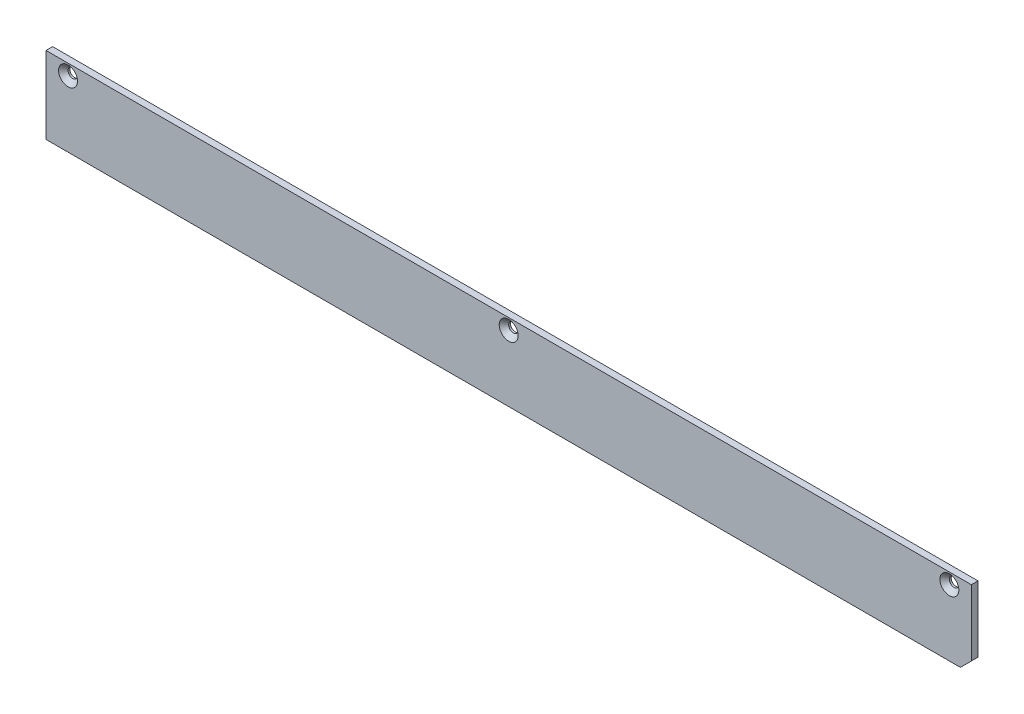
ISO-10303-21;
HEADER;
FILE_DESCRIPTION(('STEP AP214'),'2;1');
FILE_NAME('part.step','',(''),(''),'','','');
FILE_SCHEMA(('AUTOMOTIVE_DESIGN { 1 0 10303 214 1 1 1 1 }'));
ENDSEC;
DATA;
#1=APPLICATION_CONTEXT('core data for automotive mechanical design processes');
#2=APPLICATION_PROTOCOL_DEFINITION('international standard','automotive_design',2000,#1);
#3=PRODUCT_CONTEXT('',#1,'mechanical');
#4=PRODUCT('Part','Part','',(#3));
#5=PRODUCT_RELATED_PRODUCT_CATEGORY('part','',(#4));
#6=PRODUCT_DEFINITION_FORMATION('','',#4);
#7=PRODUCT_DEFINITION_CONTEXT('part definition',#1,'design');
#8=PRODUCT_DEFINITION('design','',#6,#7);
#9=PRODUCT_DEFINITION_SHAPE('','',#8);
#10=(LENGTH_UNIT() NAMED_UNIT(*) SI_UNIT(.MILLI.,.METRE.));
#11=(NAMED_UNIT(*) PLANE_ANGLE_UNIT() SI_UNIT($,.RADIAN.));
#12=(NAMED_UNIT(*) SI_UNIT($,.STERADIAN.) SOLID_ANGLE_UNIT());
#13=UNCERTAINTY_MEASURE_WITH_UNIT(LENGTH_MEASURE(1.E-05),#10,'distance_accuracy_value','');
#14=(GEOMETRIC_REPRESENTATION_CONTEXT(3) GLOBAL_UNCERTAINTY_ASSIGNED_CONTEXT((#13)) GLOBAL_UNIT_ASSIGNED_CONTEXT((#10,
#11,#12)) REPRESENTATION_CONTEXT('',''));
#15=CARTESIAN_POINT('',(0.,0.,0.));
#16=DIRECTION('',(0.,0.,1.));
#17=DIRECTION('',(1.,0.,0.));
#18=AXIS2_PLACEMENT_3D('',#15,#16,#17);
#19=CARTESIAN_POINT('',(0.,0.,2.99999999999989));
#20=DIRECTION('',(1.,0.,0.));
#21=DIRECTION('',(0.,0.,-0.999999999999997));
#22=AXIS2_PLACEMENT_3D('',#19,#20,#21);
#23=PLANE('',#22);
#24=DIRECTION('',(0.,-1.,0.));
#25=VECTOR('',#24,1.);
#26=CARTESIAN_POINT('',(0.,0.,0.));
#27=LINE('',#26,#25);
#28=CARTESIAN_POINT('',(4.9960036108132E-13,35.0000000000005,-4.44089209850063E-13));
#29=VERTEX_POINT('',#28);
#30=CARTESIAN_POINT('',(0.,0.,0.));
#31=VERTEX_POINT('',#30);
#32=EDGE_CURVE('E100',#29,#31,#27,.T.);
#33=ORIENTED_EDGE('',*,*,#32,.T.);
#34=DIRECTION('',(0.,0.,-0.999999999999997));
#35=VECTOR('',#34,1.);
#36=CARTESIAN_POINT('',(0.,0.,2.99999999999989));
#37=LINE('',#36,#35);
#38=CARTESIAN_POINT('',(0.,0.,2.99999999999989));
#39=VERTEX_POINT('',#38);
#40=EDGE_CURVE('E83',#39,#31,#37,.T.);
#41=ORIENTED_EDGE('',*,*,#40,.F.);
#42=DIRECTION('',(0.,-1.,0.));
#43=VECTOR('',#42,1.);
#44=CARTESIAN_POINT('',(0.,0.,2.99999999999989));
#45=LINE('',#44,#43);
#46=CARTESIAN_POINT('',(7.7715611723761E-13,35.0000000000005,2.99999999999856));
#47=VERTEX_POINT('',#46);
#48=EDGE_CURVE('E88',#47,#39,#45,.T.);
#49=ORIENTED_EDGE('',*,*,#48,.F.);
#50=DIRECTION('',(0.,0.,-0.999999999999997));
#51=VECTOR('',#50,1.);
#52=CARTESIAN_POINT('',(7.7715611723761E-13,35.0000000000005,2.99999999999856));
#53=LINE('',#52,#51);
#54=EDGE_CURVE('E107',#47,#29,#53,.T.);
#55=ORIENTED_EDGE('',*,*,#54,.T.);
#56=EDGE_LOOP('',(#33,#41,#49,#55));
#57=FACE_BOUND('',#56,.T.);
#58=ADVANCED_FACE('F36',(#57),#23,.F.);
#59=CARTESIAN_POINT('',(0.,0.,2.99999999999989));
#60=DIRECTION('',(0.,1.,0.));
#61=DIRECTION('',(0.,0.,0.999999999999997));
#62=AXIS2_PLACEMENT_3D('',#59,#60,#61);
#63=PLANE('',#62);
#64=DIRECTION('',(1.,0.,0.));
#65=VECTOR('',#64,1.);
#66=CARTESIAN_POINT('',(0.,0.,0.));
#67=LINE('',#66,#65);
#68=CARTESIAN_POINT('',(415.000000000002,0.,-6.66133814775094E-13));
#69=VERTEX_POINT('',#68);
#70=EDGE_CURVE('E115',#31,#69,#67,.T.);
#71=ORIENTED_EDGE('',*,*,#70,.T.);
#72=DIRECTION('',(0.,0.,0.999999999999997));
#73=VECTOR('',#72,1.);
#74=CARTESIAN_POINT('',(415.000000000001,2.4980018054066E-13,2.99999999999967));
#75=LINE('',#74,#73);
#76=CARTESIAN_POINT('',(415.000000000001,2.4980018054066E-13,2.99999999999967));
#77=VERTEX_POINT('',#76);
#78=EDGE_CURVE('E44',#69,#77,#75,.T.);
#79=ORIENTED_EDGE('',*,*,#78,.T.);
#80=DIRECTION('',(1.,0.,0.));
#81=VECTOR('',#80,1.);
#82=CARTESIAN_POINT('',(0.,0.,2.99999999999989));
#83=LINE('',#82,#81);
#84=EDGE_CURVE('E79',#39,#77,#83,.T.);
#85=ORIENTED_EDGE('',*,*,#84,.F.);
#86=ORIENTED_EDGE('',*,*,#40,.T.);
#87=EDGE_LOOP('',(#71,#79,#85,#86));
#88=FACE_BOUND('',#87,.T.);
#89=ADVANCED_FACE('F81',(#88),#63,.F.);
#90=CARTESIAN_POINT('',(420.000000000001,1.94289029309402E-13,2.99999999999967));
#91=DIRECTION('',(-1.,0.,0.));
#92=DIRECTION('',(0.,0.,0.999999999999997));
#93=AXIS2_PLACEMENT_3D('',#90,#91,#92);
#94=PLANE('',#93);
#95=DIRECTION('',(0.,1.,0.));
#96=VECTOR('',#95,1.);
#97=CARTESIAN_POINT('',(420.000000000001,1.94289029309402E-13,2.99999999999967));
#98=LINE('',#97,#96);
#99=CARTESIAN_POINT('',(420.000000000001,4.99999999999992,2.99999999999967));
#100=VERTEX_POINT('',#99);
#101=CARTESIAN_POINT('',(420.000000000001,35.0000000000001,2.99999999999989));
#102=VERTEX_POINT('',#101);
#103=EDGE_CURVE('E87',#100,#102,#98,.T.);
#104=ORIENTED_EDGE('',*,*,#103,.F.);
#105=DIRECTION('',(0.,0.,-0.999999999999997));
#106=VECTOR('',#105,1.);
#107=CARTESIAN_POINT('',(420.000000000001,4.99999999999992,2.99999999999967));
#108=LINE('',#107,#106);
#109=CARTESIAN_POINT('',(420.000000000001,5.00000000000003,-7.7715611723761E-13));
#110=VERTEX_POINT('',#109);
#111=EDGE_CURVE('E101',#100,#110,#108,.T.);
#112=ORIENTED_EDGE('',*,*,#111,.T.);
#113=DIRECTION('',(0.,1.,0.));
#114=VECTOR('',#113,1.);
#115=CARTESIAN_POINT('',(420.000000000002,4.44089209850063E-13,-6.66133814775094E-13));
#116=LINE('',#115,#114);
#117=CARTESIAN_POINT('',(420.000000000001,35.,-4.44089209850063E-13));
#118=VERTEX_POINT('',#117);
#119=EDGE_CURVE('E113',#110,#118,#116,.T.);
#120=ORIENTED_EDGE('',*,*,#119,.T.);
#121=DIRECTION('',(0.,0.,-0.999999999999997));
#122=VECTOR('',#121,1.);
#123=CARTESIAN_POINT('',(420.000000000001,35.0000000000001,2.99999999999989));
#124=LINE('',#123,#122);
#125=EDGE_CURVE('E102',#102,#118,#124,.T.);
#126=ORIENTED_EDGE('',*,*,#125,.F.);
#127=EDGE_LOOP('',(#104,#112,#120,#126));
#128=FACE_BOUND('',#127,.T.);
#129=ADVANCED_FACE('F173',(#128),#94,.F.);
#130=CARTESIAN_POINT('',(7.7715611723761E-13,35.0000000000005,2.99999999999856));
#131=DIRECTION('',(0.,-1.,0.));
#132=DIRECTION('',(0.,0.,-0.999999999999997));
#133=AXIS2_PLACEMENT_3D('',#130,#131,#132);
#134=PLANE('',#133);
#135=DIRECTION('',(-1.,0.,0.));
#136=VECTOR('',#135,1.);
#137=CARTESIAN_POINT('',(4.9960036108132E-13,35.0000000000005,-4.44089209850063E-13));
#138=LINE('',#137,#136);
#139=EDGE_CURVE('E97',#118,#29,#138,.T.);
#140=ORIENTED_EDGE('',*,*,#139,.T.);
#141=ORIENTED_EDGE('',*,*,#54,.F.);
#142=DIRECTION('',(-1.,0.,0.));
#143=VECTOR('',#142,1.);
#144=CARTESIAN_POINT('',(7.7715611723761E-13,35.0000000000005,2.99999999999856));
#145=LINE('',#144,#143);
#146=EDGE_CURVE('E93',#102,#47,#145,.T.);
#147=ORIENTED_EDGE('',*,*,#146,.F.);
#148=ORIENTED_EDGE('',*,*,#125,.T.);
#149=EDGE_LOOP('',(#140,#141,#147,#148));
#150=FACE_BOUND('',#149,.T.);
#151=ADVANCED_FACE('F165',(#150),#134,.F.);
#152=CARTESIAN_POINT('',(0.,0.,2.99999999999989));
#153=DIRECTION('',(0.,0.,-0.999999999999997));
#154=DIRECTION('',(-1.,0.,0.));
#155=AXIS2_PLACEMENT_3D('',#152,#153,#154);
#156=PLANE('',#155);
#157=CARTESIAN_POINT('',(10.0000000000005,30.0000000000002,2.99999999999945));
#158=DIRECTION('',(0.,0.,0.999999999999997));
#159=DIRECTION('',(1.,0.,0.));
#160=AXIS2_PLACEMENT_3D('',#157,#158,#159);
#161=CIRCLE('',#160,4.3);
#162=CARTESIAN_POINT('',(14.3000000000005,30.0000000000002,2.99999999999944));
#163=VERTEX_POINT('',#162);
#164=EDGE_CURVE('E118',#163,#163,#161,.T.);
#165=ORIENTED_EDGE('',*,*,#164,.F.);
#166=EDGE_LOOP('',(#165));
#167=FACE_BOUND('',#166,.T.);
#168=CARTESIAN_POINT('',(210.000000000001,30.0000000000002,2.99999999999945));
#169=DIRECTION('',(0.,0.,0.999999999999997));
#170=DIRECTION('',(1.,0.,0.));
#171=AXIS2_PLACEMENT_3D('',#168,#169,#170);
#172=CIRCLE('',#171,4.3);
#173=CARTESIAN_POINT('',(214.300000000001,30.0000000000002,2.99999999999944));
#174=VERTEX_POINT('',#173);
#175=EDGE_CURVE('E124',#174,#174,#172,.T.);
#176=ORIENTED_EDGE('',*,*,#175,.F.);
#177=EDGE_LOOP('',(#176));
#178=FACE_BOUND('',#177,.T.);
#179=CARTESIAN_POINT('',(410.000000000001,30.0000000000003,2.99999999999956));
#180=DIRECTION('',(0.,0.,0.999999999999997));
#181=DIRECTION('',(1.,0.,0.));
#182=AXIS2_PLACEMENT_3D('',#179,#180,#181);
#183=CIRCLE('',#182,4.30000000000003);
#184=CARTESIAN_POINT('',(414.300000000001,30.0000000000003,2.99999999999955));
#185=VERTEX_POINT('',#184);
#186=EDGE_CURVE('E121',#185,#185,#183,.T.);
#187=ORIENTED_EDGE('',*,*,#186,.F.);
#188=EDGE_LOOP('',(#187));
#189=FACE_BOUND('',#188,.T.);
#190=ORIENTED_EDGE('',*,*,#84,.T.);
#191=DIRECTION('',(-0.707106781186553,-0.707106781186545,0.));
#192=VECTOR('',#191,1.);
#193=CARTESIAN_POINT('',(420.000000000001,4.99999999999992,2.99999999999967));
#194=LINE('',#193,#192);
#195=EDGE_CURVE('E11',#77,#100,#194,.F.);
#196=ORIENTED_EDGE('',*,*,#195,.T.);
#197=ORIENTED_EDGE('',*,*,#103,.T.);
#198=ORIENTED_EDGE('',*,*,#146,.T.);
#199=ORIENTED_EDGE('',*,*,#48,.T.);
#200=EDGE_LOOP('',(#190,#196,#197,#198,#199));
#201=FACE_BOUND('',#200,.T.);
#202=ADVANCED_FACE('F91',(#167,#178,#189,#201),#156,.F.);
#203=CARTESIAN_POINT('',(0.,0.,0.));
#204=DIRECTION('',(0.,0.,-0.999999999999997));
#205=DIRECTION('',(-1.,0.,0.));
#206=AXIS2_PLACEMENT_3D('',#203,#204,#205);
#207=PLANE('',#206);
#208=CARTESIAN_POINT('',(410.000000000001,30.,-2.22044604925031E-13));
#209=DIRECTION('',(0.,0.,0.999999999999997));
#210=DIRECTION('',(1.,0.,0.));
#211=AXIS2_PLACEMENT_3D('',#208,#209,#210);
#212=CIRCLE('',#211,2.15000000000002);
#213=CARTESIAN_POINT('',(412.150000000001,30.,-2.24849305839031E-13));
#214=VERTEX_POINT('',#213);
#215=EDGE_CURVE('E139',#214,#214,#212,.T.);
#216=ORIENTED_EDGE('',*,*,#215,.T.);
#217=EDGE_LOOP('',(#216));
#218=FACE_BOUND('',#217,.T.);
#219=CARTESIAN_POINT('',(210.000000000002,30.0000000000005,-6.66133814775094E-13));
#220=DIRECTION('',(0.,0.,0.999999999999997));
#221=DIRECTION('',(1.,0.,0.));
#222=AXIS2_PLACEMENT_3D('',#219,#220,#221);
#223=CIRCLE('',#222,2.15000000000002);
#224=CARTESIAN_POINT('',(212.150000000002,30.0000000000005,-6.68938515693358E-13));
#225=VERTEX_POINT('',#224);
#226=EDGE_CURVE('E133',#225,#225,#223,.T.);
#227=ORIENTED_EDGE('',*,*,#226,.T.);
#228=EDGE_LOOP('',(#227));
#229=FACE_BOUND('',#228,.T.);
#230=CARTESIAN_POINT('',(10.0000000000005,30.0000000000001,-2.22044604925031E-13));
#231=DIRECTION('',(0.,0.,0.999999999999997));
#232=DIRECTION('',(1.,0.,0.));
#233=AXIS2_PLACEMENT_3D('',#230,#231,#232);
#234=CIRCLE('',#233,2.14999999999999);
#235=CARTESIAN_POINT('',(12.1500000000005,30.0000000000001,-2.24849305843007E-13));
#236=VERTEX_POINT('',#235);
#237=EDGE_CURVE('E125',#236,#236,#234,.T.);
#238=ORIENTED_EDGE('',*,*,#237,.T.);
#239=EDGE_LOOP('',(#238));
#240=FACE_BOUND('',#239,.T.);
#241=ORIENTED_EDGE('',*,*,#119,.F.);
#242=DIRECTION('',(0.707106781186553,0.707106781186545,0.));
#243=VECTOR('',#242,1.);
#244=CARTESIAN_POINT('',(207.499999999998,-207.5,-2.22044604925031E-13));
#245=LINE('',#244,#243);
#246=EDGE_CURVE('E58',#110,#69,#245,.F.);
#247=ORIENTED_EDGE('',*,*,#246,.T.);
#248=ORIENTED_EDGE('',*,*,#70,.F.);
#249=ORIENTED_EDGE('',*,*,#32,.F.);
#250=ORIENTED_EDGE('',*,*,#139,.F.);
#251=EDGE_LOOP('',(#241,#247,#248,#249,#250));
#252=FACE_BOUND('',#251,.T.);
#253=ADVANCED_FACE('F148',(#218,#229,#240,#252),#207,.T.);
#254=CARTESIAN_POINT('',(410.000000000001,30.0000000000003,2.99999999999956));
#255=DIRECTION('',(0.,0.,0.999999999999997));
#256=DIRECTION('',(1.,0.,0.));
#257=AXIS2_PLACEMENT_3D('',#254,#255,#256);
#258=CONICAL_SURFACE('',#257,4.30000000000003,0.78539816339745);
#259=CARTESIAN_POINT('',(410.,30.,0.849999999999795));
#260=DIRECTION('',(0.,0.,0.999999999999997));
#261=DIRECTION('',(1.,0.,0.));
#262=AXIS2_PLACEMENT_3D('',#259,#260,#261);
#263=CIRCLE('',#262,2.15000000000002);
#264=CARTESIAN_POINT('',(412.150000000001,30.0000000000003,0.849999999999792));
#265=VERTEX_POINT('',#264);
#266=EDGE_CURVE('E142',#265,#265,#263,.T.);
#267=CARTESIAN_POINT('',(412.150000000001,30.0000000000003,0.849999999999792));
#268=CARTESIAN_POINT('',(412.172395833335,30.0000000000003,0.87239583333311));
#269=CARTESIAN_POINT('',(412.194791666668,30.0000000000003,0.894791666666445));
#270=CARTESIAN_POINT('',(412.239583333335,30.0000000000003,0.939583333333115));
#271=CARTESIAN_POINT('',(412.261979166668,30.0000000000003,0.96197916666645));
#272=CARTESIAN_POINT('',(412.306770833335,30.0000000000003,1.00677083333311));
#273=CARTESIAN_POINT('',(412.329166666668,30.0000000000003,1.02916666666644));
#274=CARTESIAN_POINT('',(412.373958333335,30.0000000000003,1.0739583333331));
#275=CARTESIAN_POINT('',(412.396354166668,30.0000000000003,1.09635416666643));
#276=CARTESIAN_POINT('',(412.441145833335,30.0000000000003,1.14114583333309));
#277=CARTESIAN_POINT('',(412.463541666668,30.0000000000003,1.16354166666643));
#278=CARTESIAN_POINT('',(412.508333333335,30.0000000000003,1.20833333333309));
#279=CARTESIAN_POINT('',(412.530729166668,30.0000000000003,1.23072916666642));
#280=CARTESIAN_POINT('',(412.575520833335,30.0000000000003,1.27552083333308));
#281=CARTESIAN_POINT('',(412.597916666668,30.0000000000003,1.2979166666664));
#282=CARTESIAN_POINT('',(412.642708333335,30.0000000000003,1.34270833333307));
#283=CARTESIAN_POINT('',(412.665104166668,30.0000000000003,1.36510416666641));
#284=CARTESIAN_POINT('',(412.709895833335,30.0000000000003,1.40989583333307));
#285=CARTESIAN_POINT('',(412.732291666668,30.0000000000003,1.4322916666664));
#286=CARTESIAN_POINT('',(412.777083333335,30.0000000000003,1.47708333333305));
#287=CARTESIAN_POINT('',(412.799479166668,30.0000000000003,1.49947916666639));
#288=CARTESIAN_POINT('',(412.844270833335,30.0000000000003,1.54427083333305));
#289=CARTESIAN_POINT('',(412.866666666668,30.0000000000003,1.56666666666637));
#290=CARTESIAN_POINT('',(412.911458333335,30.0000000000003,1.61145833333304));
#291=CARTESIAN_POINT('',(412.933854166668,30.0000000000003,1.63385416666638));
#292=CARTESIAN_POINT('',(412.978645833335,30.0000000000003,1.67864583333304));
#293=CARTESIAN_POINT('',(413.001041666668,30.0000000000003,1.70104166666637));
#294=CARTESIAN_POINT('',(413.045833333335,30.0000000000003,1.74583333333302));
#295=CARTESIAN_POINT('',(413.068229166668,30.0000000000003,1.76822916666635));
#296=CARTESIAN_POINT('',(413.113020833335,30.0000000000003,1.81302083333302));
#297=CARTESIAN_POINT('',(413.135416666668,30.0000000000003,1.83541666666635));
#298=CARTESIAN_POINT('',(413.180208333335,30.0000000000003,1.88020833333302));
#299=CARTESIAN_POINT('',(413.202604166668,30.0000000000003,1.90260416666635));
#300=CARTESIAN_POINT('',(413.247395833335,30.0000000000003,1.947395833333));
#301=CARTESIAN_POINT('',(413.269791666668,30.0000000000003,1.96979166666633));
#302=CARTESIAN_POINT('',(413.314583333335,30.0000000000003,2.01458333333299));
#303=CARTESIAN_POINT('',(413.336979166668,30.0000000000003,2.03697916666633));
#304=CARTESIAN_POINT('',(413.381770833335,30.0000000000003,2.08177083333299));
#305=CARTESIAN_POINT('',(413.404166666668,30.0000000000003,2.10416666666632));
#306=CARTESIAN_POINT('',(413.448958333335,30.0000000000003,2.14895833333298));
#307=CARTESIAN_POINT('',(413.471354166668,30.0000000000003,2.17135416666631));
#308=CARTESIAN_POINT('',(413.516145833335,30.0000000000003,2.21614583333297));
#309=CARTESIAN_POINT('',(413.538541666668,30.0000000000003,2.2385416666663));
#310=CARTESIAN_POINT('',(413.583333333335,30.0000000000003,2.28333333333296));
#311=CARTESIAN_POINT('',(413.605729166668,30.0000000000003,2.3057291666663));
#312=CARTESIAN_POINT('',(413.650520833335,30.0000000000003,2.35052083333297));
#313=CARTESIAN_POINT('',(413.672916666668,30.0000000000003,2.37291666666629));
#314=CARTESIAN_POINT('',(413.717708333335,30.0000000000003,2.41770833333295));
#315=CARTESIAN_POINT('',(413.740104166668,30.0000000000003,2.44010416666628));
#316=CARTESIAN_POINT('',(413.784895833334,30.0000000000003,2.48489583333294));
#317=CARTESIAN_POINT('',(413.807291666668,30.0000000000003,2.50729166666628));
#318=CARTESIAN_POINT('',(413.852083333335,30.0000000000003,2.55208333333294));
#319=CARTESIAN_POINT('',(413.874479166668,30.0000000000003,2.57447916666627));
#320=CARTESIAN_POINT('',(413.919270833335,30.0000000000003,2.61927083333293));
#321=CARTESIAN_POINT('',(413.941666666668,30.0000000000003,2.64166666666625));
#322=CARTESIAN_POINT('',(413.986458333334,30.0000000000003,2.68645833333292));
#323=CARTESIAN_POINT('',(414.008854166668,30.0000000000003,2.70885416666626));
#324=CARTESIAN_POINT('',(414.053645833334,30.0000000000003,2.75364583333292));
#325=CARTESIAN_POINT('',(414.076041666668,30.0000000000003,2.77604166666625));
#326=CARTESIAN_POINT('',(414.120833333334,30.0000000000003,2.8208333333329));
#327=CARTESIAN_POINT('',(414.143229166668,30.0000000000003,2.84322916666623));
#328=CARTESIAN_POINT('',(414.188020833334,30.0000000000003,2.8880208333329));
#329=CARTESIAN_POINT('',(414.210416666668,30.0000000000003,2.91041666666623));
#330=CARTESIAN_POINT('',(414.255208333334,30.0000000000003,2.9552083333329));
#331=CARTESIAN_POINT('',(414.277604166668,30.0000000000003,2.97760416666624));
#332=CARTESIAN_POINT('',(414.300000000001,30.0000000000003,2.99999999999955));
#333=B_SPLINE_CURVE_WITH_KNOTS('',3,(#267,#268,#269,#270,#271,#272,#273,#274,#275,#276,#277,
#278,#279,#280,#281,#282,#283,#284,#285,#286,#287,#288,#289,#290,#291,#292,#293,#294,#295,#296,
#297,#298,#299,#300,#301,#302,#303,#304,#305,#306,#307,#308,#309,#310,#311,#312,#313,#314,#315,
#316,#317,#318,#319,#320,#321,#322,#323,#324,#325,#326,#327,#328,#329,#330,#331,#332),
.UNSPECIFIED.,.F.,.F.,(4,2,2,2,2,2,2,2,2,2,2,2,2,2,2,2,2,2,2,2,2,2,2,2,2,2,2,2,2,2,2,2,4),(0.,
0.0950174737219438,0.190034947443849,0.285052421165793,0.380069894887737,0.475087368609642,
0.570104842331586,0.66512231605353,0.760139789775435,0.855157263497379,0.950174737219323,
1.04519221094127,1.14020968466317,1.23522715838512,1.33024463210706,1.42526210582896,
1.52027957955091,1.61529705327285,1.71031452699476,1.8053320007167,1.90034947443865,
1.99536694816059,2.0903844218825,2.18540189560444,2.28041936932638,2.37543684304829,
2.47045431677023,2.56547179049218,2.66048926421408,2.75550673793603,2.85052421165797,
2.94554168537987,3.04055915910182),.UNSPECIFIED.);
#334=EDGE_CURVE('BSEAM158',#265,#185,#333,.T.);
#335=ORIENTED_EDGE('',*,*,#266,.F.);
#336=ORIENTED_EDGE('',*,*,#186,.T.);
#337=ORIENTED_EDGE('',*,*,#334,.T.);
#338=ORIENTED_EDGE('',*,*,#334,.F.);
#339=EDGE_LOOP('',(#335,#337,#336,#338));
#340=FACE_BOUND('',#339,.T.);
#341=ADVANCED_FACE('F158',(#340),#258,.F.);
#342=CARTESIAN_POINT('',(210.000000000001,30.0000000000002,2.99999999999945));
#343=DIRECTION('',(0.,0.,0.999999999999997));
#344=DIRECTION('',(1.,0.,0.));
#345=AXIS2_PLACEMENT_3D('',#342,#343,#344);
#346=CONICAL_SURFACE('',#345,4.3,0.78539816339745);
#347=CARTESIAN_POINT('',(210.000000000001,30.0000000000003,0.850000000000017));
#348=DIRECTION('',(0.,0.,0.999999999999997));
#349=DIRECTION('',(1.,0.,0.));
#350=AXIS2_PLACEMENT_3D('',#347,#348,#349);
#351=CIRCLE('',#350,2.15000000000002);
#352=CARTESIAN_POINT('',(212.150000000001,30.0000000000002,0.850000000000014));
#353=VERTEX_POINT('',#352);
#354=EDGE_CURVE('E136',#353,#353,#351,.T.);
#355=CARTESIAN_POINT('',(212.150000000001,30.0000000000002,0.850000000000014));
#356=CARTESIAN_POINT('',(212.172395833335,30.0000000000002,0.872395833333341));
#357=CARTESIAN_POINT('',(212.194791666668,30.0000000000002,0.894791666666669));
#358=CARTESIAN_POINT('',(212.239583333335,30.0000000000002,0.939583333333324));
#359=CARTESIAN_POINT('',(212.261979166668,30.0000000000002,0.961979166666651));
#360=CARTESIAN_POINT('',(212.306770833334,30.0000000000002,1.00677083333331));
#361=CARTESIAN_POINT('',(212.329166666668,30.0000000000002,1.02916666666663));
#362=CARTESIAN_POINT('',(212.373958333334,30.0000000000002,1.07395833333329));
#363=CARTESIAN_POINT('',(212.396354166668,30.0000000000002,1.09635416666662));
#364=CARTESIAN_POINT('',(212.441145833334,30.0000000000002,1.14114583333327));
#365=CARTESIAN_POINT('',(212.463541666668,30.0000000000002,1.1635416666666));
#366=CARTESIAN_POINT('',(212.508333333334,30.0000000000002,1.20833333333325));
#367=CARTESIAN_POINT('',(212.530729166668,30.0000000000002,1.23072916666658));
#368=CARTESIAN_POINT('',(212.575520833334,30.0000000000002,1.27552083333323));
#369=CARTESIAN_POINT('',(212.597916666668,30.0000000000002,1.29791666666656));
#370=CARTESIAN_POINT('',(212.642708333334,30.0000000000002,1.34270833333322));
#371=CARTESIAN_POINT('',(212.665104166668,30.0000000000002,1.36510416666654));
#372=CARTESIAN_POINT('',(212.709895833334,30.0000000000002,1.4098958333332));
#373=CARTESIAN_POINT('',(212.732291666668,30.0000000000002,1.43229166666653));
#374=CARTESIAN_POINT('',(212.777083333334,30.0000000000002,1.47708333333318));
#375=CARTESIAN_POINT('',(212.799479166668,30.0000000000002,1.49947916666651));
#376=CARTESIAN_POINT('',(212.844270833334,30.0000000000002,1.54427083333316));
#377=CARTESIAN_POINT('',(212.866666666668,30.0000000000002,1.56666666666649));
#378=CARTESIAN_POINT('',(212.911458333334,30.0000000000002,1.61145833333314));
#379=CARTESIAN_POINT('',(212.933854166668,30.0000000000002,1.63385416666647));
#380=CARTESIAN_POINT('',(212.978645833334,30.0000000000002,1.67864583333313));
#381=CARTESIAN_POINT('',(213.001041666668,30.0000000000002,1.70104166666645));
#382=CARTESIAN_POINT('',(213.045833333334,30.0000000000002,1.74583333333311));
#383=CARTESIAN_POINT('',(213.068229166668,30.0000000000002,1.76822916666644));
#384=CARTESIAN_POINT('',(213.113020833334,30.0000000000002,1.81302083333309));
#385=CARTESIAN_POINT('',(213.135416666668,30.0000000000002,1.83541666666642));
#386=CARTESIAN_POINT('',(213.180208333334,30.0000000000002,1.88020833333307));
#387=CARTESIAN_POINT('',(213.202604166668,30.0000000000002,1.9026041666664));
#388=CARTESIAN_POINT('',(213.247395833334,30.0000000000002,1.94739583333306));
#389=CARTESIAN_POINT('',(213.269791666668,30.0000000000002,1.96979166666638));
#390=CARTESIAN_POINT('',(213.314583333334,30.0000000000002,2.01458333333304));
#391=CARTESIAN_POINT('',(213.336979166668,30.0000000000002,2.03697916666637));
#392=CARTESIAN_POINT('',(213.381770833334,30.0000000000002,2.08177083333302));
#393=CARTESIAN_POINT('',(213.404166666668,30.0000000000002,2.10416666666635));
#394=CARTESIAN_POINT('',(213.448958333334,30.0000000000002,2.148958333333));
#395=CARTESIAN_POINT('',(213.471354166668,30.0000000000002,2.17135416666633));
#396=CARTESIAN_POINT('',(213.516145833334,30.0000000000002,2.21614583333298));
#397=CARTESIAN_POINT('',(213.538541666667,30.0000000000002,2.23854166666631));
#398=CARTESIAN_POINT('',(213.583333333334,30.0000000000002,2.28333333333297));
#399=CARTESIAN_POINT('',(213.605729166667,30.0000000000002,2.30572916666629));
#400=CARTESIAN_POINT('',(213.650520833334,30.0000000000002,2.35052083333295));
#401=CARTESIAN_POINT('',(213.672916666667,30.0000000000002,2.37291666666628));
#402=CARTESIAN_POINT('',(213.717708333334,30.0000000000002,2.41770833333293));
#403=CARTESIAN_POINT('',(213.740104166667,30.0000000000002,2.44010416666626));
#404=CARTESIAN_POINT('',(213.784895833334,30.0000000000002,2.48489583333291));
#405=CARTESIAN_POINT('',(213.807291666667,30.0000000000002,2.50729166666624));
#406=CARTESIAN_POINT('',(213.852083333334,30.0000000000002,2.55208333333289));
#407=CARTESIAN_POINT('',(213.874479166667,30.0000000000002,2.57447916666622));
#408=CARTESIAN_POINT('',(213.919270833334,30.0000000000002,2.61927083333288));
#409=CARTESIAN_POINT('',(213.941666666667,30.0000000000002,2.6416666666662));
#410=CARTESIAN_POINT('',(213.986458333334,30.0000000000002,2.68645833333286));
#411=CARTESIAN_POINT('',(214.008854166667,30.0000000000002,2.70885416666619));
#412=CARTESIAN_POINT('',(214.053645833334,30.0000000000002,2.75364583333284));
#413=CARTESIAN_POINT('',(214.076041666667,30.0000000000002,2.77604166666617));
#414=CARTESIAN_POINT('',(214.120833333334,30.0000000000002,2.82083333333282));
#415=CARTESIAN_POINT('',(214.143229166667,30.0000000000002,2.84322916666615));
#416=CARTESIAN_POINT('',(214.188020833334,30.0000000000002,2.88802083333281));
#417=CARTESIAN_POINT('',(214.210416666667,30.0000000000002,2.91041666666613));
#418=CARTESIAN_POINT('',(214.255208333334,30.0000000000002,2.95520833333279));
#419=CARTESIAN_POINT('',(214.277604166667,30.0000000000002,2.97760416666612));
#420=CARTESIAN_POINT('',(214.300000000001,30.0000000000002,2.99999999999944));
#421=B_SPLINE_CURVE_WITH_KNOTS('',3,(#355,#356,#357,#358,#359,#360,#361,#362,#363,#364,#365,
#366,#367,#368,#369,#370,#371,#372,#373,#374,#375,#376,#377,#378,#379,#380,#381,#382,#383,#384,
#385,#386,#387,#388,#389,#390,#391,#392,#393,#394,#395,#396,#397,#398,#399,#400,#401,#402,#403,
#404,#405,#406,#407,#408,#409,#410,#411,#412,#413,#414,#415,#416,#417,#418,#419,#420),
.UNSPECIFIED.,.F.,.F.,(4,2,2,2,2,2,2,2,2,2,2,2,2,2,2,2,2,2,2,2,2,2,2,2,2,2,2,2,2,2,2,2,4),(0.,
0.0950174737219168,0.190034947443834,0.285052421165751,0.380069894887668,0.475087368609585,
0.570104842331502,0.66512231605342,0.760139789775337,0.855157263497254,0.950174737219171,
1.04519221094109,1.14020968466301,1.23522715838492,1.33024463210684,1.42526210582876,
1.52027957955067,1.61529705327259,1.71031452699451,1.80533200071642,1.90034947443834,
1.99536694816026,2.09038442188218,2.18540189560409,2.28041936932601,2.37543684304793,
2.47045431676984,2.56547179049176,2.66048926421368,2.75550673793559,2.85052421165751,
2.94554168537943,3.04055915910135),.UNSPECIFIED.);
#422=EDGE_CURVE('BSEAM161',#353,#174,#421,.T.);
#423=ORIENTED_EDGE('',*,*,#354,.F.);
#424=ORIENTED_EDGE('',*,*,#175,.T.);
#425=ORIENTED_EDGE('',*,*,#422,.T.);
#426=ORIENTED_EDGE('',*,*,#422,.F.);
#427=EDGE_LOOP('',(#423,#425,#424,#426));
#428=FACE_BOUND('',#427,.T.);
#429=ADVANCED_FACE('F161',(#428),#346,.F.);
#430=CARTESIAN_POINT('',(10.0000000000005,30.0000000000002,2.99999999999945));
#431=DIRECTION('',(0.,0.,0.999999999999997));
#432=DIRECTION('',(1.,0.,0.));
#433=AXIS2_PLACEMENT_3D('',#430,#431,#432);
#434=CONICAL_SURFACE('',#433,4.3,0.78539816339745);
#435=CARTESIAN_POINT('',(10.0000000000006,30.0000000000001,0.849999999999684));
#436=DIRECTION('',(0.,0.,0.999999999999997));
#437=DIRECTION('',(1.,0.,0.));
#438=AXIS2_PLACEMENT_3D('',#435,#436,#437);
#439=CIRCLE('',#438,2.14999999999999);
#440=CARTESIAN_POINT('',(12.1500000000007,30.0000000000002,0.849999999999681));
#441=VERTEX_POINT('',#440);
#442=EDGE_CURVE('E130',#441,#441,#439,.T.);
#443=CARTESIAN_POINT('',(12.1500000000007,30.0000000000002,0.849999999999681));
#444=CARTESIAN_POINT('',(12.172395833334,30.0000000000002,0.872395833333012));
#445=CARTESIAN_POINT('',(12.1947916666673,30.0000000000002,0.894791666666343));
#446=CARTESIAN_POINT('',(12.239583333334,30.0000000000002,0.939583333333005));
#447=CARTESIAN_POINT('',(12.2619791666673,30.0000000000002,0.961979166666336));
#448=CARTESIAN_POINT('',(12.306770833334,30.0000000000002,1.006770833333));
#449=CARTESIAN_POINT('',(12.3291666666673,30.0000000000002,1.02916666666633));
#450=CARTESIAN_POINT('',(12.373958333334,30.0000000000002,1.07395833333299));
#451=CARTESIAN_POINT('',(12.3963541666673,30.0000000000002,1.09635416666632));
#452=CARTESIAN_POINT('',(12.441145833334,30.0000000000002,1.14114583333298));
#453=CARTESIAN_POINT('',(12.4635416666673,30.0000000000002,1.16354166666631));
#454=CARTESIAN_POINT('',(12.508333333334,30.0000000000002,1.20833333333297));
#455=CARTESIAN_POINT('',(12.5307291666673,30.0000000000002,1.23072916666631));
#456=CARTESIAN_POINT('',(12.575520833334,30.0000000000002,1.27552083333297));
#457=CARTESIAN_POINT('',(12.5979166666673,30.0000000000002,1.2979166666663));
#458=CARTESIAN_POINT('',(12.642708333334,30.0000000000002,1.34270833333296));
#459=CARTESIAN_POINT('',(12.6651041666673,30.0000000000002,1.36510416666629));
#460=CARTESIAN_POINT('',(12.7098958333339,30.0000000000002,1.40989583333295));
#461=CARTESIAN_POINT('',(12.7322916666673,30.0000000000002,1.43229166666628));
#462=CARTESIAN_POINT('',(12.7770833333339,30.0000000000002,1.47708333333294));
#463=CARTESIAN_POINT('',(12.7994791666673,30.0000000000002,1.49947916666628));
#464=CARTESIAN_POINT('',(12.8442708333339,30.0000000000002,1.54427083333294));
#465=CARTESIAN_POINT('',(12.8666666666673,30.0000000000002,1.56666666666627));
#466=CARTESIAN_POINT('',(12.9114583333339,30.0000000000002,1.61145833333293));
#467=CARTESIAN_POINT('',(12.9338541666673,30.0000000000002,1.63385416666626));
#468=CARTESIAN_POINT('',(12.9786458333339,30.0000000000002,1.67864583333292));
#469=CARTESIAN_POINT('',(13.0010416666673,30.0000000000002,1.70104166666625));
#470=CARTESIAN_POINT('',(13.0458333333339,30.0000000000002,1.74583333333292));
#471=CARTESIAN_POINT('',(13.0682291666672,30.0000000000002,1.76822916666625));
#472=CARTESIAN_POINT('',(13.1130208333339,30.0000000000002,1.81302083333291));
#473=CARTESIAN_POINT('',(13.1354166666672,30.0000000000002,1.83541666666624));
#474=CARTESIAN_POINT('',(13.1802083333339,30.0000000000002,1.8802083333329));
#475=CARTESIAN_POINT('',(13.2026041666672,30.0000000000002,1.90260416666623));
#476=CARTESIAN_POINT('',(13.2473958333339,30.0000000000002,1.94739583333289));
#477=CARTESIAN_POINT('',(13.2697916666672,30.0000000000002,1.96979166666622));
#478=CARTESIAN_POINT('',(13.3145833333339,30.0000000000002,2.01458333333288));
#479=CARTESIAN_POINT('',(13.3369791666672,30.0000000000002,2.03697916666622));
#480=CARTESIAN_POINT('',(13.3817708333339,30.0000000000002,2.08177083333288));
#481=CARTESIAN_POINT('',(13.4041666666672,30.0000000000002,2.10416666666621));
#482=CARTESIAN_POINT('',(13.4489583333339,30.0000000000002,2.14895833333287));
#483=CARTESIAN_POINT('',(13.4713541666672,30.0000000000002,2.1713541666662));
#484=CARTESIAN_POINT('',(13.5161458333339,30.0000000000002,2.21614583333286));
#485=CARTESIAN_POINT('',(13.5385416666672,30.0000000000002,2.23854166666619));
#486=CARTESIAN_POINT('',(13.5833333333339,30.0000000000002,2.28333333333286));
#487=CARTESIAN_POINT('',(13.6057291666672,30.0000000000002,2.30572916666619));
#488=CARTESIAN_POINT('',(13.6505208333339,30.0000000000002,2.35052083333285));
#489=CARTESIAN_POINT('',(13.6729166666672,30.0000000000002,2.37291666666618));
#490=CARTESIAN_POINT('',(13.7177083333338,30.0000000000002,2.41770833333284));
#491=CARTESIAN_POINT('',(13.7401041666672,30.0000000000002,2.44010416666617));
#492=CARTESIAN_POINT('',(13.7848958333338,30.0000000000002,2.48489583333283));
#493=CARTESIAN_POINT('',(13.8072916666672,30.0000000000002,2.50729166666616));
#494=CARTESIAN_POINT('',(13.8520833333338,30.0000000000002,2.55208333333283));
#495=CARTESIAN_POINT('',(13.8744791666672,30.0000000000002,2.57447916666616));
#496=CARTESIAN_POINT('',(13.9192708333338,30.0000000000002,2.61927083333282));
#497=CARTESIAN_POINT('',(13.9416666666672,30.0000000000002,2.64166666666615));
#498=CARTESIAN_POINT('',(13.9864583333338,30.0000000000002,2.68645833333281));
#499=CARTESIAN_POINT('',(14.0088541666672,30.0000000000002,2.70885416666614));
#500=CARTESIAN_POINT('',(14.0536458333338,30.0000000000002,2.7536458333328));
#501=CARTESIAN_POINT('',(14.0760416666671,30.0000000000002,2.77604166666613));
#502=CARTESIAN_POINT('',(14.1208333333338,30.0000000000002,2.8208333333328));
#503=CARTESIAN_POINT('',(14.1432291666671,30.0000000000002,2.84322916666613));
#504=CARTESIAN_POINT('',(14.1880208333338,30.0000000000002,2.88802083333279));
#505=CARTESIAN_POINT('',(14.2104166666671,30.0000000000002,2.91041666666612));
#506=CARTESIAN_POINT('',(14.2552083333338,30.0000000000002,2.95520833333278));
#507=CARTESIAN_POINT('',(14.2776041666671,30.0000000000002,2.97760416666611));
#508=CARTESIAN_POINT('',(14.3000000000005,30.0000000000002,2.99999999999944));
#509=B_SPLINE_CURVE_WITH_KNOTS('',3,(#443,#444,#445,#446,#447,#448,#449,#450,#451,#452,#453,
#454,#455,#456,#457,#458,#459,#460,#461,#462,#463,#464,#465,#466,#467,#468,#469,#470,#471,#472,
#473,#474,#475,#476,#477,#478,#479,#480,#481,#482,#483,#484,#485,#486,#487,#488,#489,#490,#491,
#492,#493,#494,#495,#496,#497,#498,#499,#500,#501,#502,#503,#504,#505,#506,#507,#508),
.UNSPECIFIED.,.F.,.F.,(4,2,2,2,2,2,2,2,2,2,2,2,2,2,2,2,2,2,2,2,2,2,2,2,2,2,2,2,2,2,2,2,4),(0.,
0.0950174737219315,0.190034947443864,0.285052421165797,0.38006989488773,0.475087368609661,
0.570104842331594,0.665122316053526,0.760139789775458,0.85515726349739,0.950174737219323,
1.04519221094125,1.14020968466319,1.23522715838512,1.33024463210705,1.42526210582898,
1.52027957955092,1.61529705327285,1.71031452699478,1.80533200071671,1.90034947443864,
1.99536694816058,2.09038442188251,2.18540189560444,2.28041936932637,2.37543684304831,
2.47045431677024,2.56547179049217,2.6604892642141,2.75550673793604,2.85052421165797,
2.9455416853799,3.04055915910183),.UNSPECIFIED.);
#510=EDGE_CURVE('BSEAM187',#441,#163,#509,.T.);
#511=ORIENTED_EDGE('',*,*,#442,.F.);
#512=ORIENTED_EDGE('',*,*,#164,.T.);
#513=ORIENTED_EDGE('',*,*,#510,.T.);
#514=ORIENTED_EDGE('',*,*,#510,.F.);
#515=EDGE_LOOP('',(#511,#513,#512,#514));
#516=FACE_BOUND('',#515,.T.);
#517=ADVANCED_FACE('F187',(#516),#434,.F.);
#518=CARTESIAN_POINT('',(10.0000000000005,30.0000000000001,-2.22044604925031E-13));
#519=DIRECTION('',(0.,0.,0.999999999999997));
#520=DIRECTION('',(1.,0.,0.));
#521=AXIS2_PLACEMENT_3D('',#518,#519,#520);
#522=CYLINDRICAL_SURFACE('',#521,2.14999999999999);
#523=CARTESIAN_POINT('',(12.1500000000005,30.0000000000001,-2.24849305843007E-13));
#524=CARTESIAN_POINT('',(12.1500000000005,30.0000000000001,0.00885416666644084));
#525=CARTESIAN_POINT('',(12.1500000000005,30.0000000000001,0.0177083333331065));
#526=CARTESIAN_POINT('',(12.1500000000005,30.0000000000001,0.0354166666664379));
#527=CARTESIAN_POINT('',(12.1500000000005,30.0000000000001,0.0442708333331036));
#528=CARTESIAN_POINT('',(12.1500000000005,30.0000000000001,0.061979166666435));
#529=CARTESIAN_POINT('',(12.1500000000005,30.0000000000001,0.0708333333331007));
#530=CARTESIAN_POINT('',(12.1500000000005,30.0000000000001,0.0885416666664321));
#531=CARTESIAN_POINT('',(12.1500000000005,30.0000000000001,0.0973958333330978));
#532=CARTESIAN_POINT('',(12.1500000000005,30.0000000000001,0.115104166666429));
#533=CARTESIAN_POINT('',(12.1500000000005,30.0000000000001,0.123958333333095));
#534=CARTESIAN_POINT('',(12.1500000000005,30.0000000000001,0.141666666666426));
#535=CARTESIAN_POINT('',(12.1500000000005,30.0000000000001,0.150520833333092));
#536=CARTESIAN_POINT('',(12.1500000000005,30.0000000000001,0.168229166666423));
#537=CARTESIAN_POINT('',(12.1500000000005,30.0000000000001,0.177083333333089));
#538=CARTESIAN_POINT('',(12.1500000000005,30.0000000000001,0.19479166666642));
#539=CARTESIAN_POINT('',(12.1500000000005,30.0000000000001,0.203645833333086));
#540=CARTESIAN_POINT('',(12.1500000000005,30.0000000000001,0.221354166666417));
#541=CARTESIAN_POINT('',(12.1500000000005,30.0000000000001,0.230208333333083));
#542=CARTESIAN_POINT('',(12.1500000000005,30.0000000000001,0.247916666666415));
#543=CARTESIAN_POINT('',(12.1500000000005,30.0000000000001,0.25677083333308));
#544=CARTESIAN_POINT('',(12.1500000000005,30.0000000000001,0.274479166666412));
#545=CARTESIAN_POINT('',(12.1500000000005,30.0000000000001,0.283333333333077));
#546=CARTESIAN_POINT('',(12.1500000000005,30.0000000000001,0.301041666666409));
#547=CARTESIAN_POINT('',(12.1500000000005,30.0000000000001,0.309895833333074));
#548=CARTESIAN_POINT('',(12.1500000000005,30.0000000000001,0.327604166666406));
#549=CARTESIAN_POINT('',(12.1500000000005,30.0000000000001,0.336458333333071));
#550=CARTESIAN_POINT('',(12.1500000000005,30.0000000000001,0.354166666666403));
#551=CARTESIAN_POINT('',(12.1500000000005,30.0000000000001,0.363020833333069));
#552=CARTESIAN_POINT('',(12.1500000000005,30.0000000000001,0.3807291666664));
#553=CARTESIAN_POINT('',(12.1500000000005,30.0000000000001,0.389583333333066));
#554=CARTESIAN_POINT('',(12.1500000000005,30.0000000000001,0.407291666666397));
#555=CARTESIAN_POINT('',(12.1500000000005,30.0000000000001,0.416145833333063));
#556=CARTESIAN_POINT('',(12.1500000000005,30.0000000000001,0.433854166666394));
#557=CARTESIAN_POINT('',(12.1500000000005,30.0000000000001,0.44270833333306));
#558=CARTESIAN_POINT('',(12.1500000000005,30.0000000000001,0.460416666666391));
#559=CARTESIAN_POINT('',(12.1500000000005,30.0000000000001,0.469270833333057));
#560=CARTESIAN_POINT('',(12.1500000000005,30.0000000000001,0.486979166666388));
#561=CARTESIAN_POINT('',(12.1500000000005,30.0000000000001,0.495833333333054));
#562=CARTESIAN_POINT('',(12.1500000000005,30.0000000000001,0.513541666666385));
#563=CARTESIAN_POINT('',(12.1500000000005,30.0000000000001,0.522395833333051));
#564=CARTESIAN_POINT('',(12.1500000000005,30.0000000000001,0.540104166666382));
#565=CARTESIAN_POINT('',(12.1500000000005,30.0000000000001,0.548958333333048));
#566=CARTESIAN_POINT('',(12.1500000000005,30.0000000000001,0.566666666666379));
#567=CARTESIAN_POINT('',(12.1500000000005,30.0000000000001,0.575520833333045));
#568=CARTESIAN_POINT('',(12.1500000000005,30.0000000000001,0.593229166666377));
#569=CARTESIAN_POINT('',(12.1500000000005,30.0000000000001,0.602083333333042));
#570=CARTESIAN_POINT('',(12.1500000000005,30.0000000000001,0.619791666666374));
#571=CARTESIAN_POINT('',(12.1500000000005,30.0000000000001,0.628645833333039));
#572=CARTESIAN_POINT('',(12.1500000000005,30.0000000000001,0.646354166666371));
#573=CARTESIAN_POINT('',(12.1500000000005,30.0000000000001,0.655208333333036));
#574=CARTESIAN_POINT('',(12.1500000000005,30.0000000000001,0.672916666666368));
#575=CARTESIAN_POINT('',(12.1500000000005,30.0000000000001,0.681770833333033));
#576=CARTESIAN_POINT('',(12.1500000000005,30.0000000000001,0.699479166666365));
#577=CARTESIAN_POINT('',(12.1500000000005,30.0000000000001,0.708333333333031));
#578=CARTESIAN_POINT('',(12.1500000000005,30.0000000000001,0.726041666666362));
#579=CARTESIAN_POINT('',(12.1500000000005,30.0000000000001,0.734895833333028));
#580=CARTESIAN_POINT('',(12.1500000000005,30.0000000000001,0.752604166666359));
#581=CARTESIAN_POINT('',(12.1500000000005,30.0000000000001,0.761458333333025));
#582=CARTESIAN_POINT('',(12.1500000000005,30.0000000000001,0.779166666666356));
#583=CARTESIAN_POINT('',(12.1500000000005,30.0000000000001,0.788020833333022));
#584=CARTESIAN_POINT('',(12.1500000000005,30.0000000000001,0.805729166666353));
#585=CARTESIAN_POINT('',(12.1500000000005,30.0000000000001,0.814583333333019));
#586=CARTESIAN_POINT('',(12.1500000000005,30.0000000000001,0.83229166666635));
#587=CARTESIAN_POINT('',(12.1500000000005,30.0000000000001,0.841145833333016));
#588=CARTESIAN_POINT('',(12.1500000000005,30.0000000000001,0.849999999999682));
#589=B_SPLINE_CURVE_WITH_KNOTS('',3,(#523,#524,#525,#526,#527,#528,#529,#530,#531,#532,#533,
#534,#535,#536,#537,#538,#539,#540,#541,#542,#543,#544,#545,#546,#547,#548,#549,#550,#551,#552,
#553,#554,#555,#556,#557,#558,#559,#560,#561,#562,#563,#564,#565,#566,#567,#568,#569,#570,#571,
#572,#573,#574,#575,#576,#577,#578,#579,#580,#581,#582,#583,#584,#585,#586,#587,#588),
.UNSPECIFIED.,.F.,.F.,(4,2,2,2,2,2,2,2,2,2,2,2,2,2,2,2,2,2,2,2,2,2,2,2,2,2,2,2,2,2,2,2,4),(0.,
0.0265624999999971,0.0531249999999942,0.0796874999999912,0.106249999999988,0.132812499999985,
0.159374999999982,0.18593749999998,0.212499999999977,0.239062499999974,0.265624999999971,
0.292187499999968,0.318749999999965,0.345312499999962,0.371874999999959,0.398437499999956,
0.424999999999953,0.45156249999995,0.478124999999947,0.504687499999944,0.531249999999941,
0.557812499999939,0.584374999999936,0.610937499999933,0.63749999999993,0.664062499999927,
0.690624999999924,0.717187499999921,0.743749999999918,0.770312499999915,0.796874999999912,
0.823437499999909,0.849999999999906),.UNSPECIFIED.);
#590=EDGE_CURVE('BSEAM190',#236,#441,#589,.T.);
#591=ORIENTED_EDGE('',*,*,#237,.F.);
#592=ORIENTED_EDGE('',*,*,#442,.T.);
#593=ORIENTED_EDGE('',*,*,#590,.T.);
#594=ORIENTED_EDGE('',*,*,#590,.F.);
#595=EDGE_LOOP('',(#591,#593,#592,#594));
#596=FACE_BOUND('',#595,.T.);
#597=ADVANCED_FACE('F190',(#596),#522,.F.);
#598=CARTESIAN_POINT('',(210.000000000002,30.0000000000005,-6.66133814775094E-13));
#599=DIRECTION('',(0.,0.,0.999999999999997));
#600=DIRECTION('',(1.,0.,0.));
#601=AXIS2_PLACEMENT_3D('',#598,#599,#600);
#602=CYLINDRICAL_SURFACE('',#601,2.15000000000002);
#603=CARTESIAN_POINT('',(212.150000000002,30.0000000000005,-6.68938515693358E-13));
#604=CARTESIAN_POINT('',(212.150000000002,30.0000000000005,0.00885416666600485));
#605=CARTESIAN_POINT('',(212.150000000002,30.0000000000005,0.0177083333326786));
#606=CARTESIAN_POINT('',(212.150000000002,30.0000000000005,0.0354166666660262));
#607=CARTESIAN_POINT('',(212.150000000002,30.0000000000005,0.0442708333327));
#608=CARTESIAN_POINT('',(212.150000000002,30.0000000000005,0.0619791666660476));
#609=CARTESIAN_POINT('',(212.150000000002,30.0000000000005,0.0708333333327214));
#610=CARTESIAN_POINT('',(212.150000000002,30.0000000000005,0.0885416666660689));
#611=CARTESIAN_POINT('',(212.150000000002,30.0000000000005,0.0973958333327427));
#612=CARTESIAN_POINT('',(212.150000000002,30.0000000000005,0.11510416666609));
#613=CARTESIAN_POINT('',(212.150000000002,30.0000000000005,0.123958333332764));
#614=CARTESIAN_POINT('',(212.150000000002,30.0000000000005,0.141666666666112));
#615=CARTESIAN_POINT('',(212.150000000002,30.0000000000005,0.150520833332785));
#616=CARTESIAN_POINT('',(212.150000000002,30.0000000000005,0.168229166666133));
#617=CARTESIAN_POINT('',(212.150000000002,30.0000000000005,0.177083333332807));
#618=CARTESIAN_POINT('',(212.150000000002,30.0000000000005,0.194791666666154));
#619=CARTESIAN_POINT('',(212.150000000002,30.0000000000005,0.203645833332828));
#620=CARTESIAN_POINT('',(212.150000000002,30.0000000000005,0.221354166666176));
#621=CARTESIAN_POINT('',(212.150000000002,30.0000000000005,0.23020833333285));
#622=CARTESIAN_POINT('',(212.150000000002,30.0000000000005,0.247916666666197));
#623=CARTESIAN_POINT('',(212.150000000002,30.0000000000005,0.256770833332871));
#624=CARTESIAN_POINT('',(212.150000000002,30.0000000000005,0.274479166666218));
#625=CARTESIAN_POINT('',(212.150000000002,30.0000000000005,0.283333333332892));
#626=CARTESIAN_POINT('',(212.150000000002,30.0000000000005,0.30104166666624));
#627=CARTESIAN_POINT('',(212.150000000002,30.0000000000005,0.309895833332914));
#628=CARTESIAN_POINT('',(212.150000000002,30.0000000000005,0.327604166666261));
#629=CARTESIAN_POINT('',(212.150000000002,30.0000000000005,0.336458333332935));
#630=CARTESIAN_POINT('',(212.150000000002,30.0000000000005,0.354166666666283));
#631=CARTESIAN_POINT('',(212.150000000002,30.0000000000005,0.363020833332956));
#632=CARTESIAN_POINT('',(212.150000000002,30.0000000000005,0.380729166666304));
#633=CARTESIAN_POINT('',(212.150000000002,30.0000000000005,0.389583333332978));
#634=CARTESIAN_POINT('',(212.150000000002,30.0000000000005,0.407291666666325));
#635=CARTESIAN_POINT('',(212.150000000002,30.0000000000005,0.416145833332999));
#636=CARTESIAN_POINT('',(212.150000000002,30.0000000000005,0.433854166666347));
#637=CARTESIAN_POINT('',(212.150000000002,30.0000000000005,0.44270833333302));
#638=CARTESIAN_POINT('',(212.150000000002,30.0000000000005,0.460416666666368));
#639=CARTESIAN_POINT('',(212.150000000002,30.0000000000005,0.469270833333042));
#640=CARTESIAN_POINT('',(212.150000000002,30.0000000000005,0.486979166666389));
#641=CARTESIAN_POINT('',(212.150000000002,30.0000000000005,0.495833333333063));
#642=CARTESIAN_POINT('',(212.150000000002,30.0000000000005,0.513541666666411));
#643=CARTESIAN_POINT('',(212.150000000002,30.0000000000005,0.522395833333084));
#644=CARTESIAN_POINT('',(212.150000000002,30.0000000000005,0.540104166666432));
#645=CARTESIAN_POINT('',(212.150000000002,30.0000000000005,0.548958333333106));
#646=CARTESIAN_POINT('',(212.150000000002,30.0000000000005,0.566666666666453));
#647=CARTESIAN_POINT('',(212.150000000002,30.0000000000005,0.575520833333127));
#648=CARTESIAN_POINT('',(212.150000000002,30.0000000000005,0.593229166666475));
#649=CARTESIAN_POINT('',(212.150000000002,30.0000000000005,0.602083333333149));
#650=CARTESIAN_POINT('',(212.150000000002,30.0000000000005,0.619791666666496));
#651=CARTESIAN_POINT('',(212.150000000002,30.0000000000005,0.62864583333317));
#652=CARTESIAN_POINT('',(212.150000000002,30.0000000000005,0.646354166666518));
#653=CARTESIAN_POINT('',(212.150000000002,30.0000000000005,0.655208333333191));
#654=CARTESIAN_POINT('',(212.150000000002,30.0000000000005,0.672916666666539));
#655=CARTESIAN_POINT('',(212.150000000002,30.0000000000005,0.681770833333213));
#656=CARTESIAN_POINT('',(212.150000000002,30.0000000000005,0.69947916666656));
#657=CARTESIAN_POINT('',(212.150000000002,30.0000000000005,0.708333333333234));
#658=CARTESIAN_POINT('',(212.150000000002,30.0000000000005,0.726041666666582));
#659=CARTESIAN_POINT('',(212.150000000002,30.0000000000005,0.734895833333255));
#660=CARTESIAN_POINT('',(212.150000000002,30.0000000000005,0.752604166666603));
#661=CARTESIAN_POINT('',(212.150000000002,30.0000000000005,0.761458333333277));
#662=CARTESIAN_POINT('',(212.150000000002,30.0000000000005,0.779166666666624));
#663=CARTESIAN_POINT('',(212.150000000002,30.0000000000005,0.788020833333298));
#664=CARTESIAN_POINT('',(212.150000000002,30.0000000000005,0.805729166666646));
#665=CARTESIAN_POINT('',(212.150000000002,30.0000000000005,0.81458333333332));
#666=CARTESIAN_POINT('',(212.150000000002,30.0000000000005,0.832291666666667));
#667=CARTESIAN_POINT('',(212.150000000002,30.0000000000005,0.841145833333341));
#668=CARTESIAN_POINT('',(212.150000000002,30.0000000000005,0.850000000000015));
#669=B_SPLINE_CURVE_WITH_KNOTS('',3,(#603,#604,#605,#606,#607,#608,#609,#610,#611,#612,#613,
#614,#615,#616,#617,#618,#619,#620,#621,#622,#623,#624,#625,#626,#627,#628,#629,#630,#631,#632,
#633,#634,#635,#636,#637,#638,#639,#640,#641,#642,#643,#644,#645,#646,#647,#648,#649,#650,#651,
#652,#653,#654,#655,#656,#657,#658,#659,#660,#661,#662,#663,#664,#665,#666,#667,#668),
.UNSPECIFIED.,.F.,.F.,(4,2,2,2,2,2,2,2,2,2,2,2,2,2,2,2,2,2,2,2,2,2,2,2,2,2,2,2,2,2,2,2,4),(0.,
0.0265625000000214,0.0531250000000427,0.0796875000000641,0.106250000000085,0.132812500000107,
0.159375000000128,0.18593750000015,0.212500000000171,0.239062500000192,0.265625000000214,
0.292187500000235,0.318750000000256,0.345312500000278,0.371875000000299,0.39843750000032,
0.425000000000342,0.451562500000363,0.478125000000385,0.504687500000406,0.531250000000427,
0.557812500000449,0.58437500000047,0.610937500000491,0.637500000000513,0.664062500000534,
0.690625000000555,0.717187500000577,0.743750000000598,0.77031250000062,0.796875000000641,
0.823437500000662,0.850000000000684),.UNSPECIFIED.);
#670=EDGE_CURVE('BSEAM154',#225,#353,#669,.T.);
#671=ORIENTED_EDGE('',*,*,#226,.F.);
#672=ORIENTED_EDGE('',*,*,#354,.T.);
#673=ORIENTED_EDGE('',*,*,#670,.T.);
#674=ORIENTED_EDGE('',*,*,#670,.F.);
#675=EDGE_LOOP('',(#671,#673,#672,#674));
#676=FACE_BOUND('',#675,.T.);
#677=ADVANCED_FACE('F154',(#676),#602,.F.);
#678=CARTESIAN_POINT('',(410.000000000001,30.,-2.22044604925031E-13));
#679=DIRECTION('',(0.,0.,0.999999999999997));
#680=DIRECTION('',(1.,0.,0.));
#681=AXIS2_PLACEMENT_3D('',#678,#679,#680);
#682=CYLINDRICAL_SURFACE('',#681,2.15000000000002);
#683=CARTESIAN_POINT('',(412.150000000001,30.,-2.24849305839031E-13));
#684=CARTESIAN_POINT('',(412.150000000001,30.,0.008854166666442));
#685=CARTESIAN_POINT('',(412.150000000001,30.,0.0177083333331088));
#686=CARTESIAN_POINT('',(412.150000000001,30.,0.0354166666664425));
#687=CARTESIAN_POINT('',(412.150000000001,30.,0.0442708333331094));
#688=CARTESIAN_POINT('',(412.150000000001,30.,0.0619791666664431));
#689=CARTESIAN_POINT('',(412.150000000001,30.,0.0708333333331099));
#690=CARTESIAN_POINT('',(412.150000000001,30.,0.0885416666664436));
#691=CARTESIAN_POINT('',(412.150000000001,30.,0.0973958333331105));
#692=CARTESIAN_POINT('',(412.150000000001,30.,0.115104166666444));
#693=CARTESIAN_POINT('',(412.150000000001,30.,0.123958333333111));
#694=CARTESIAN_POINT('',(412.150000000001,30.,0.141666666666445));
#695=CARTESIAN_POINT('',(412.150000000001,30.,0.150520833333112));
#696=CARTESIAN_POINT('',(412.150000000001,30.,0.168229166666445));
#697=CARTESIAN_POINT('',(412.150000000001,30.,0.177083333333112));
#698=CARTESIAN_POINT('',(412.150000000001,30.,0.194791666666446));
#699=CARTESIAN_POINT('',(412.150000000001,30.,0.203645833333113));
#700=CARTESIAN_POINT('',(412.150000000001,30.,0.221354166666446));
#701=CARTESIAN_POINT('',(412.150000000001,30.,0.230208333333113));
#702=CARTESIAN_POINT('',(412.150000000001,30.,0.247916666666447));
#703=CARTESIAN_POINT('',(412.150000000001,30.,0.256770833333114));
#704=CARTESIAN_POINT('',(412.150000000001,30.,0.274479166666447));
#705=CARTESIAN_POINT('',(412.150000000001,30.,0.283333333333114));
#706=CARTESIAN_POINT('',(412.150000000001,30.,0.301041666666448));
#707=CARTESIAN_POINT('',(412.150000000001,30.,0.309895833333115));
#708=CARTESIAN_POINT('',(412.150000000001,30.,0.327604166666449));
#709=CARTESIAN_POINT('',(412.150000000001,30.,0.336458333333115));
#710=CARTESIAN_POINT('',(412.150000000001,30.,0.354166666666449));
#711=CARTESIAN_POINT('',(412.150000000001,30.,0.363020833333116));
#712=CARTESIAN_POINT('',(412.150000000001,30.,0.38072916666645));
#713=CARTESIAN_POINT('',(412.150000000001,30.,0.389583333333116));
#714=CARTESIAN_POINT('',(412.150000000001,30.,0.40729166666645));
#715=CARTESIAN_POINT('',(412.150000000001,30.,0.416145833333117));
#716=CARTESIAN_POINT('',(412.150000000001,30.,0.433854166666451));
#717=CARTESIAN_POINT('',(412.150000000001,30.,0.442708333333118));
#718=CARTESIAN_POINT('',(412.150000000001,30.,0.460416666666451));
#719=CARTESIAN_POINT('',(412.150000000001,30.,0.469270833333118));
#720=CARTESIAN_POINT('',(412.150000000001,30.,0.486979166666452));
#721=CARTESIAN_POINT('',(412.150000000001,30.,0.495833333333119));
#722=CARTESIAN_POINT('',(412.150000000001,30.,0.513541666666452));
#723=CARTESIAN_POINT('',(412.150000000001,30.,0.522395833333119));
#724=CARTESIAN_POINT('',(412.150000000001,30.,0.540104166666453));
#725=CARTESIAN_POINT('',(412.150000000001,30.,0.54895833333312));
#726=CARTESIAN_POINT('',(412.150000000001,30.,0.566666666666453));
#727=CARTESIAN_POINT('',(412.150000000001,30.,0.57552083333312));
#728=CARTESIAN_POINT('',(412.150000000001,30.,0.593229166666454));
#729=CARTESIAN_POINT('',(412.150000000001,30.,0.602083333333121));
#730=CARTESIAN_POINT('',(412.150000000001,30.,0.619791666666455));
#731=CARTESIAN_POINT('',(412.150000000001,30.,0.628645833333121));
#732=CARTESIAN_POINT('',(412.150000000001,30.,0.646354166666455));
#733=CARTESIAN_POINT('',(412.150000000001,30.,0.655208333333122));
#734=CARTESIAN_POINT('',(412.150000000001,30.,0.672916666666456));
#735=CARTESIAN_POINT('',(412.150000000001,30.,0.681770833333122));
#736=CARTESIAN_POINT('',(412.150000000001,30.,0.699479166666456));
#737=CARTESIAN_POINT('',(412.150000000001,30.,0.708333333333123));
#738=CARTESIAN_POINT('',(412.150000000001,30.,0.726041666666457));
#739=CARTESIAN_POINT('',(412.150000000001,30.,0.734895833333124));
#740=CARTESIAN_POINT('',(412.150000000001,30.,0.752604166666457));
#741=CARTESIAN_POINT('',(412.150000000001,30.,0.761458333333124));
#742=CARTESIAN_POINT('',(412.150000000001,30.,0.779166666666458));
#743=CARTESIAN_POINT('',(412.150000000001,30.,0.788020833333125));
#744=CARTESIAN_POINT('',(412.150000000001,30.,0.805729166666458));
#745=CARTESIAN_POINT('',(412.150000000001,30.,0.814583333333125));
#746=CARTESIAN_POINT('',(412.150000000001,30.,0.832291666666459));
#747=CARTESIAN_POINT('',(412.150000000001,30.,0.841145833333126));
#748=CARTESIAN_POINT('',(412.150000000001,30.,0.849999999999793));
#749=B_SPLINE_CURVE_WITH_KNOTS('',3,(#683,#684,#685,#686,#687,#688,#689,#690,#691,#692,#693,
#694,#695,#696,#697,#698,#699,#700,#701,#702,#703,#704,#705,#706,#707,#708,#709,#710,#711,#712,
#713,#714,#715,#716,#717,#718,#719,#720,#721,#722,#723,#724,#725,#726,#727,#728,#729,#730,#731,
#732,#733,#734,#735,#736,#737,#738,#739,#740,#741,#742,#743,#744,#745,#746,#747,#748),
.UNSPECIFIED.,.F.,.F.,(4,2,2,2,2,2,2,2,2,2,2,2,2,2,2,2,2,2,2,2,2,2,2,2,2,2,2,2,2,2,2,2,4),(0.,
0.0265625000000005,0.0531250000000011,0.0796875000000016,0.106250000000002,0.132812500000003,
0.159375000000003,0.185937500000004,0.212500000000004,0.239062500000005,0.265625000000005,
0.292187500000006,0.318750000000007,0.345312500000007,0.371875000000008,0.398437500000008,
0.425000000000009,0.451562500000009,0.47812500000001,0.50468750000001,0.531250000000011,
0.557812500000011,0.584375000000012,0.610937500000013,0.637500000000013,0.664062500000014,
0.690625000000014,0.717187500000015,0.743750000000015,0.770312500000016,0.796875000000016,
0.823437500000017,0.850000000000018),.UNSPECIFIED.);
#750=EDGE_CURVE('BSEAM151',#214,#265,#749,.T.);
#751=ORIENTED_EDGE('',*,*,#215,.F.);
#752=ORIENTED_EDGE('',*,*,#266,.T.);
#753=ORIENTED_EDGE('',*,*,#750,.T.);
#754=ORIENTED_EDGE('',*,*,#750,.F.);
#755=EDGE_LOOP('',(#751,#753,#752,#754));
#756=FACE_BOUND('',#755,.T.);
#757=ADVANCED_FACE('F151',(#756),#682,.F.);
#758=CARTESIAN_POINT('',(420.000000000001,4.99999999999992,2.99999999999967));
#759=DIRECTION('',(-0.707106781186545,0.707106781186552,0.));
#760=DIRECTION('',(0.,0.,-0.999999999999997));
#761=AXIS2_PLACEMENT_3D('',#758,#759,#760);
#762=PLANE('',#761);
#763=ORIENTED_EDGE('',*,*,#195,.F.);
#764=ORIENTED_EDGE('',*,*,#78,.F.);
#765=ORIENTED_EDGE('',*,*,#246,.F.);
#766=ORIENTED_EDGE('',*,*,#111,.F.);
#767=EDGE_LOOP('',(#763,#764,#765,#766));
#768=FACE_BOUND('',#767,.T.);
#769=ADVANCED_FACE('F38',(#768),#762,.F.);
#770=CLOSED_SHELL('',(#58,#89,#129,#151,#202,#253,#341,#429,#517,#597,#677,#757,#769));
#771=MANIFOLD_SOLID_BREP('B2',#770);
#772=ADVANCED_BREP_SHAPE_REPRESENTATION('',(#18,#771),#14);
#773=SHAPE_DEFINITION_REPRESENTATION(#9,#772);
ENDSEC;
END-ISO-10303-21;
